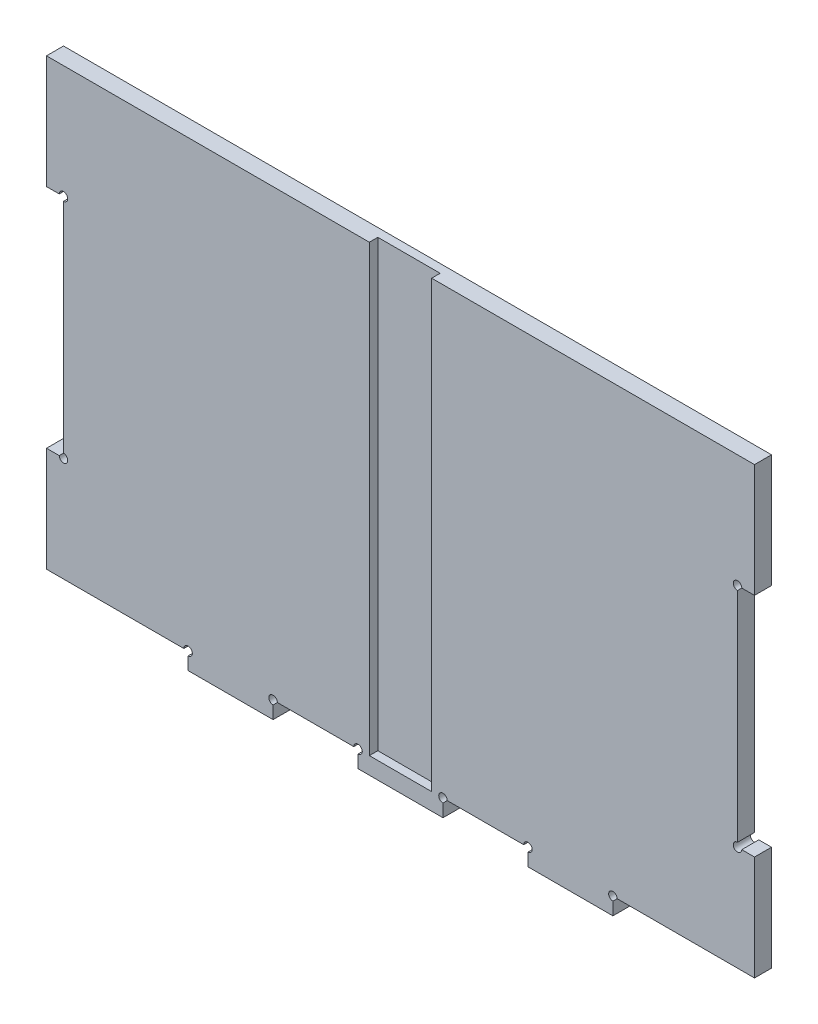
ISO-10303-21;
HEADER;
FILE_DESCRIPTION(('STEP AP214'),'2;1');
FILE_NAME('part.step','',(''),(''),'','','');
FILE_SCHEMA(('AUTOMOTIVE_DESIGN { 1 0 10303 214 1 1 1 1 }'));
ENDSEC;
DATA;
#1=APPLICATION_CONTEXT('core data for automotive mechanical design processes');
#2=APPLICATION_PROTOCOL_DEFINITION('international standard','automotive_design',2000,#1);
#3=PRODUCT_CONTEXT('',#1,'mechanical');
#4=PRODUCT('Part','Part','',(#3));
#5=PRODUCT_RELATED_PRODUCT_CATEGORY('part','',(#4));
#6=PRODUCT_DEFINITION_FORMATION('','',#4);
#7=PRODUCT_DEFINITION_CONTEXT('part definition',#1,'design');
#8=PRODUCT_DEFINITION('design','',#6,#7);
#9=PRODUCT_DEFINITION_SHAPE('','',#8);
#10=(LENGTH_UNIT() NAMED_UNIT(*) SI_UNIT(.MILLI.,.METRE.));
#11=(NAMED_UNIT(*) PLANE_ANGLE_UNIT() SI_UNIT($,.RADIAN.));
#12=(NAMED_UNIT(*) SI_UNIT($,.STERADIAN.) SOLID_ANGLE_UNIT());
#13=UNCERTAINTY_MEASURE_WITH_UNIT(LENGTH_MEASURE(1.E-05),#10,'distance_accuracy_value','');
#14=(GEOMETRIC_REPRESENTATION_CONTEXT(3) GLOBAL_UNCERTAINTY_ASSIGNED_CONTEXT((#13)) GLOBAL_UNIT_ASSIGNED_CONTEXT((#10,
#11,#12)) REPRESENTATION_CONTEXT('',''));
#15=CARTESIAN_POINT('',(0.,0.,0.));
#16=DIRECTION('',(0.,0.,1.));
#17=DIRECTION('',(1.,0.,0.));
#18=AXIS2_PLACEMENT_3D('',#15,#16,#17);
#19=CARTESIAN_POINT('',(-140.,80.,6.));
#20=DIRECTION('',(1.,0.,0.));
#21=DIRECTION('',(0.,0.,-1.));
#22=AXIS2_PLACEMENT_3D('',#19,#20,#21);
#23=PLANE('',#22);
#24=DIRECTION('',(0.,-1.,0.));
#25=VECTOR('',#24,1.);
#26=CARTESIAN_POINT('',(-140.,80.,0.));
#27=LINE('',#26,#25);
#28=CARTESIAN_POINT('',(-140.,120.,0.));
#29=VERTEX_POINT('',#28);
#30=CARTESIAN_POINT('',(-140.,80.,0.));
#31=VERTEX_POINT('',#30);
#32=EDGE_CURVE('E397',#29,#31,#27,.T.);
#33=ORIENTED_EDGE('',*,*,#32,.T.);
#34=DIRECTION('',(0.,0.,-1.));
#35=VECTOR('',#34,1.);
#36=CARTESIAN_POINT('',(-140.,80.,6.));
#37=LINE('',#36,#35);
#38=CARTESIAN_POINT('',(-140.,80.,6.));
#39=VERTEX_POINT('',#38);
#40=EDGE_CURVE('E552',#39,#31,#37,.T.);
#41=ORIENTED_EDGE('',*,*,#40,.F.);
#42=DIRECTION('',(0.,-1.,0.));
#43=VECTOR('',#42,1.);
#44=CARTESIAN_POINT('',(-140.,80.,6.));
#45=LINE('',#44,#43);
#46=CARTESIAN_POINT('',(-140.,120.,6.));
#47=VERTEX_POINT('',#46);
#48=EDGE_CURVE('E401',#47,#39,#45,.T.);
#49=ORIENTED_EDGE('',*,*,#48,.F.);
#50=DIRECTION('',(0.,0.,-1.));
#51=VECTOR('',#50,1.);
#52=CARTESIAN_POINT('',(-140.,120.,6.));
#53=LINE('',#52,#51);
#54=EDGE_CURVE('E555',#47,#29,#53,.T.);
#55=ORIENTED_EDGE('',*,*,#54,.T.);
#56=EDGE_LOOP('',(#33,#41,#49,#55));
#57=FACE_BOUND('',#56,.T.);
#58=ADVANCED_FACE('F30',(#57),#23,.F.);
#59=CARTESIAN_POINT('',(-134.,80.,6.));
#60=DIRECTION('',(0.,1.,0.));
#61=DIRECTION('',(0.,0.,1.));
#62=AXIS2_PLACEMENT_3D('',#59,#60,#61);
#63=PLANE('',#62);
#64=DIRECTION('',(1.,0.,0.));
#65=VECTOR('',#64,1.);
#66=CARTESIAN_POINT('',(-134.,80.,0.));
#67=LINE('',#66,#65);
#68=CARTESIAN_POINT('',(-135.5,80.,0.));
#69=VERTEX_POINT('',#68);
#70=EDGE_CURVE('E461',#31,#69,#67,.T.);
#71=ORIENTED_EDGE('',*,*,#70,.T.);
#72=DIRECTION('',(0.,0.,1.));
#73=VECTOR('',#72,1.);
#74=CARTESIAN_POINT('',(-135.5,80.,0.));
#75=LINE('',#74,#73);
#76=CARTESIAN_POINT('',(-135.5,80.,6.));
#77=VERTEX_POINT('',#76);
#78=EDGE_CURVE('E394',#69,#77,#75,.T.);
#79=ORIENTED_EDGE('',*,*,#78,.T.);
#80=DIRECTION('',(1.,0.,0.));
#81=VECTOR('',#80,1.);
#82=CARTESIAN_POINT('',(-134.,80.,6.));
#83=LINE('',#82,#81);
#84=EDGE_CURVE('E404',#39,#77,#83,.T.);
#85=ORIENTED_EDGE('',*,*,#84,.F.);
#86=ORIENTED_EDGE('',*,*,#40,.T.);
#87=EDGE_LOOP('',(#71,#79,#85,#86));
#88=FACE_BOUND('',#87,.T.);
#89=ADVANCED_FACE('F665',(#88),#63,.F.);
#90=CARTESIAN_POINT('',(-134.,0.,6.));
#91=DIRECTION('',(1.,0.,0.));
#92=DIRECTION('',(0.,0.,-1.));
#93=AXIS2_PLACEMENT_3D('',#90,#91,#92);
#94=PLANE('',#93);
#95=DIRECTION('',(0.,-1.,0.));
#96=VECTOR('',#95,1.);
#97=CARTESIAN_POINT('',(-134.,0.,0.));
#98=LINE('',#97,#96);
#99=CARTESIAN_POINT('',(-134.,78.5,0.));
#100=VERTEX_POINT('',#99);
#101=CARTESIAN_POINT('',(-134.,1.49999999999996,0.));
#102=VERTEX_POINT('',#101);
#103=EDGE_CURVE('E464',#100,#102,#98,.T.);
#104=ORIENTED_EDGE('',*,*,#103,.T.);
#105=DIRECTION('',(0.,0.,1.));
#106=VECTOR('',#105,1.);
#107=CARTESIAN_POINT('',(-134.,1.49999999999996,0.));
#108=LINE('',#107,#106);
#109=CARTESIAN_POINT('',(-134.,1.49999999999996,6.));
#110=VERTEX_POINT('',#109);
#111=EDGE_CURVE('E386',#102,#110,#108,.T.);
#112=ORIENTED_EDGE('',*,*,#111,.T.);
#113=DIRECTION('',(0.,-1.,0.));
#114=VECTOR('',#113,1.);
#115=CARTESIAN_POINT('',(-134.,0.,6.));
#116=LINE('',#115,#114);
#117=CARTESIAN_POINT('',(-134.,78.5,6.));
#118=VERTEX_POINT('',#117);
#119=EDGE_CURVE('E407',#118,#110,#116,.T.);
#120=ORIENTED_EDGE('',*,*,#119,.F.);
#121=DIRECTION('',(0.,0.,1.));
#122=VECTOR('',#121,1.);
#123=CARTESIAN_POINT('',(-134.,78.5,0.));
#124=LINE('',#123,#122);
#125=EDGE_CURVE('E391',#118,#100,#124,.F.);
#126=ORIENTED_EDGE('',*,*,#125,.T.);
#127=EDGE_LOOP('',(#104,#112,#120,#126));
#128=FACE_BOUND('',#127,.T.);
#129=ADVANCED_FACE('F658',(#128),#94,.F.);
#130=CARTESIAN_POINT('',(-140.,0.,6.));
#131=DIRECTION('',(0.,-1.,0.));
#132=DIRECTION('',(1.,0.,0.));
#133=AXIS2_PLACEMENT_3D('',#130,#131,#132);
#134=PLANE('',#133);
#135=DIRECTION('',(-1.,0.,0.));
#136=VECTOR('',#135,1.);
#137=CARTESIAN_POINT('',(-140.,0.,6.));
#138=LINE('',#137,#136);
#139=CARTESIAN_POINT('',(-135.5,0.,6.));
#140=VERTEX_POINT('',#139);
#141=CARTESIAN_POINT('',(-140.,0.,6.));
#142=VERTEX_POINT('',#141);
#143=EDGE_CURVE('E410',#140,#142,#138,.T.);
#144=ORIENTED_EDGE('',*,*,#143,.F.);
#145=DIRECTION('',(0.,0.,1.));
#146=VECTOR('',#145,1.);
#147=CARTESIAN_POINT('',(-135.5,0.,0.));
#148=LINE('',#147,#146);
#149=CARTESIAN_POINT('',(-135.5,0.,0.));
#150=VERTEX_POINT('',#149);
#151=EDGE_CURVE('E383',#140,#150,#148,.F.);
#152=ORIENTED_EDGE('',*,*,#151,.T.);
#153=DIRECTION('',(-1.,0.,0.));
#154=VECTOR('',#153,1.);
#155=CARTESIAN_POINT('',(-140.,0.,0.));
#156=LINE('',#155,#154);
#157=CARTESIAN_POINT('',(-140.,0.,0.));
#158=VERTEX_POINT('',#157);
#159=EDGE_CURVE('E467',#150,#158,#156,.T.);
#160=ORIENTED_EDGE('',*,*,#159,.T.);
#161=DIRECTION('',(0.,0.,-1.));
#162=VECTOR('',#161,1.);
#163=CARTESIAN_POINT('',(-140.,0.,6.));
#164=LINE('',#163,#162);
#165=EDGE_CURVE('E549',#142,#158,#164,.T.);
#166=ORIENTED_EDGE('',*,*,#165,.F.);
#167=EDGE_LOOP('',(#144,#152,#160,#166));
#168=FACE_BOUND('',#167,.T.);
#169=ADVANCED_FACE('F651',(#168),#134,.F.);
#170=CARTESIAN_POINT('',(-140.,-37.,6.));
#171=DIRECTION('',(1.,0.,0.));
#172=DIRECTION('',(0.,0.,-1.));
#173=AXIS2_PLACEMENT_3D('',#170,#171,#172);
#174=PLANE('',#173);
#175=DIRECTION('',(0.,-1.,0.));
#176=VECTOR('',#175,1.);
#177=CARTESIAN_POINT('',(-140.,-37.,0.));
#178=LINE('',#177,#176);
#179=CARTESIAN_POINT('',(-140.,-37.,0.));
#180=VERTEX_POINT('',#179);
#181=EDGE_CURVE('E469',#158,#180,#178,.T.);
#182=ORIENTED_EDGE('',*,*,#181,.T.);
#183=DIRECTION('',(0.,0.,-1.));
#184=VECTOR('',#183,1.);
#185=CARTESIAN_POINT('',(-140.,-37.,6.));
#186=LINE('',#185,#184);
#187=CARTESIAN_POINT('',(-140.,-37.,6.));
#188=VERTEX_POINT('',#187);
#189=EDGE_CURVE('E546',#188,#180,#186,.T.);
#190=ORIENTED_EDGE('',*,*,#189,.F.);
#191=DIRECTION('',(0.,-1.,0.));
#192=VECTOR('',#191,1.);
#193=CARTESIAN_POINT('',(-140.,-37.,6.));
#194=LINE('',#193,#192);
#195=EDGE_CURVE('E412',#142,#188,#194,.T.);
#196=ORIENTED_EDGE('',*,*,#195,.F.);
#197=ORIENTED_EDGE('',*,*,#165,.T.);
#198=EDGE_LOOP('',(#182,#190,#196,#197));
#199=FACE_BOUND('',#198,.T.);
#200=ADVANCED_FACE('F647',(#199),#174,.F.);
#201=CARTESIAN_POINT('',(-90.,-37.,6.));
#202=DIRECTION('',(0.,1.,0.));
#203=DIRECTION('',(-1.,0.,0.));
#204=AXIS2_PLACEMENT_3D('',#201,#202,#203);
#205=PLANE('',#204);
#206=DIRECTION('',(1.,0.,0.));
#207=VECTOR('',#206,1.);
#208=CARTESIAN_POINT('',(-90.,-37.,0.));
#209=LINE('',#208,#207);
#210=CARTESIAN_POINT('',(-91.5,-37.,0.));
#211=VERTEX_POINT('',#210);
#212=EDGE_CURVE('E471',#180,#211,#209,.T.);
#213=ORIENTED_EDGE('',*,*,#212,.T.);
#214=DIRECTION('',(0.,0.,1.));
#215=VECTOR('',#214,1.);
#216=CARTESIAN_POINT('',(-91.5,-37.,0.));
#217=LINE('',#216,#215);
#218=CARTESIAN_POINT('',(-91.5,-37.,6.));
#219=VERTEX_POINT('',#218);
#220=EDGE_CURVE('E378',#211,#219,#217,.T.);
#221=ORIENTED_EDGE('',*,*,#220,.T.);
#222=DIRECTION('',(1.,0.,0.));
#223=VECTOR('',#222,1.);
#224=CARTESIAN_POINT('',(-90.,-37.,6.));
#225=LINE('',#224,#223);
#226=EDGE_CURVE('E414',#188,#219,#225,.T.);
#227=ORIENTED_EDGE('',*,*,#226,.F.);
#228=ORIENTED_EDGE('',*,*,#189,.T.);
#229=EDGE_LOOP('',(#213,#221,#227,#228));
#230=FACE_BOUND('',#229,.T.);
#231=ADVANCED_FACE('F642',(#230),#205,.F.);
#232=CARTESIAN_POINT('',(-90.,-43.,6.));
#233=DIRECTION('',(1.,0.,0.));
#234=DIRECTION('',(0.,0.,-1.));
#235=AXIS2_PLACEMENT_3D('',#232,#233,#234);
#236=PLANE('',#235);
#237=DIRECTION('',(0.,-1.,0.));
#238=VECTOR('',#237,1.);
#239=CARTESIAN_POINT('',(-90.,-43.,6.));
#240=LINE('',#239,#238);
#241=CARTESIAN_POINT('',(-90.,-38.5,6.));
#242=VERTEX_POINT('',#241);
#243=CARTESIAN_POINT('',(-90.,-43.,6.));
#244=VERTEX_POINT('',#243);
#245=EDGE_CURVE('E417',#242,#244,#240,.T.);
#246=ORIENTED_EDGE('',*,*,#245,.F.);
#247=DIRECTION('',(0.,0.,1.));
#248=VECTOR('',#247,1.);
#249=CARTESIAN_POINT('',(-90.,-38.5,0.));
#250=LINE('',#249,#248);
#251=CARTESIAN_POINT('',(-90.,-38.5,0.));
#252=VERTEX_POINT('',#251);
#253=EDGE_CURVE('E375',#242,#252,#250,.F.);
#254=ORIENTED_EDGE('',*,*,#253,.T.);
#255=DIRECTION('',(0.,-1.,0.));
#256=VECTOR('',#255,1.);
#257=CARTESIAN_POINT('',(-90.,-43.,0.));
#258=LINE('',#257,#256);
#259=CARTESIAN_POINT('',(-90.,-43.,0.));
#260=VERTEX_POINT('',#259);
#261=EDGE_CURVE('E474',#252,#260,#258,.T.);
#262=ORIENTED_EDGE('',*,*,#261,.T.);
#263=DIRECTION('',(0.,0.,-1.));
#264=VECTOR('',#263,1.);
#265=CARTESIAN_POINT('',(-90.,-43.,6.));
#266=LINE('',#265,#264);
#267=EDGE_CURVE('E543',#244,#260,#266,.T.);
#268=ORIENTED_EDGE('',*,*,#267,.F.);
#269=EDGE_LOOP('',(#246,#254,#262,#268));
#270=FACE_BOUND('',#269,.T.);
#271=ADVANCED_FACE('F634',(#270),#236,.F.);
#272=CARTESIAN_POINT('',(-60.,-43.,6.));
#273=DIRECTION('',(0.,1.,0.));
#274=DIRECTION('',(-1.,0.,0.));
#275=AXIS2_PLACEMENT_3D('',#272,#273,#274);
#276=PLANE('',#275);
#277=DIRECTION('',(1.,0.,0.));
#278=VECTOR('',#277,1.);
#279=CARTESIAN_POINT('',(-60.,-43.,0.));
#280=LINE('',#279,#278);
#281=CARTESIAN_POINT('',(-60.,-43.,0.));
#282=VERTEX_POINT('',#281);
#283=EDGE_CURVE('E476',#260,#282,#280,.T.);
#284=ORIENTED_EDGE('',*,*,#283,.T.);
#285=DIRECTION('',(0.,0.,-1.));
#286=VECTOR('',#285,1.);
#287=CARTESIAN_POINT('',(-60.,-43.,6.));
#288=LINE('',#287,#286);
#289=CARTESIAN_POINT('',(-60.,-43.,6.));
#290=VERTEX_POINT('',#289);
#291=EDGE_CURVE('E540',#290,#282,#288,.T.);
#292=ORIENTED_EDGE('',*,*,#291,.F.);
#293=DIRECTION('',(1.,0.,0.));
#294=VECTOR('',#293,1.);
#295=CARTESIAN_POINT('',(-60.,-43.,6.));
#296=LINE('',#295,#294);
#297=EDGE_CURVE('E419',#244,#290,#296,.T.);
#298=ORIENTED_EDGE('',*,*,#297,.F.);
#299=ORIENTED_EDGE('',*,*,#267,.T.);
#300=EDGE_LOOP('',(#284,#292,#298,#299));
#301=FACE_BOUND('',#300,.T.);
#302=ADVANCED_FACE('F627',(#301),#276,.F.);
#303=CARTESIAN_POINT('',(-60.,-37.,6.));
#304=DIRECTION('',(-1.,0.,0.));
#305=DIRECTION('',(0.,0.,1.));
#306=AXIS2_PLACEMENT_3D('',#303,#304,#305);
#307=PLANE('',#306);
#308=DIRECTION('',(0.,1.,0.));
#309=VECTOR('',#308,1.);
#310=CARTESIAN_POINT('',(-60.,-37.,0.));
#311=LINE('',#310,#309);
#312=CARTESIAN_POINT('',(-60.,-38.5,0.));
#313=VERTEX_POINT('',#312);
#314=EDGE_CURVE('E478',#282,#313,#311,.T.);
#315=ORIENTED_EDGE('',*,*,#314,.T.);
#316=DIRECTION('',(0.,0.,1.));
#317=VECTOR('',#316,1.);
#318=CARTESIAN_POINT('',(-60.,-38.5,0.));
#319=LINE('',#318,#317);
#320=CARTESIAN_POINT('',(-60.,-38.5,6.));
#321=VERTEX_POINT('',#320);
#322=EDGE_CURVE('E370',#313,#321,#319,.T.);
#323=ORIENTED_EDGE('',*,*,#322,.T.);
#324=DIRECTION('',(0.,1.,0.));
#325=VECTOR('',#324,1.);
#326=CARTESIAN_POINT('',(-60.,-37.,6.));
#327=LINE('',#326,#325);
#328=EDGE_CURVE('E421',#290,#321,#327,.T.);
#329=ORIENTED_EDGE('',*,*,#328,.F.);
#330=ORIENTED_EDGE('',*,*,#291,.T.);
#331=EDGE_LOOP('',(#315,#323,#329,#330));
#332=FACE_BOUND('',#331,.T.);
#333=ADVANCED_FACE('F622',(#332),#307,.F.);
#334=CARTESIAN_POINT('',(-30.,-37.,6.));
#335=DIRECTION('',(0.,1.,0.));
#336=DIRECTION('',(-1.,0.,0.));
#337=AXIS2_PLACEMENT_3D('',#334,#335,#336);
#338=PLANE('',#337);
#339=DIRECTION('',(1.,0.,0.));
#340=VECTOR('',#339,1.);
#341=CARTESIAN_POINT('',(-30.,-37.,0.));
#342=LINE('',#341,#340);
#343=CARTESIAN_POINT('',(-58.5,-37.,0.));
#344=VERTEX_POINT('',#343);
#345=CARTESIAN_POINT('',(-31.5,-37.,0.));
#346=VERTEX_POINT('',#345);
#347=EDGE_CURVE('E481',#344,#346,#342,.T.);
#348=ORIENTED_EDGE('',*,*,#347,.T.);
#349=DIRECTION('',(0.,0.,1.));
#350=VECTOR('',#349,1.);
#351=CARTESIAN_POINT('',(-31.5,-37.,0.));
#352=LINE('',#351,#350);
#353=CARTESIAN_POINT('',(-31.5,-37.,6.));
#354=VERTEX_POINT('',#353);
#355=EDGE_CURVE('E359',#346,#354,#352,.T.);
#356=ORIENTED_EDGE('',*,*,#355,.T.);
#357=DIRECTION('',(1.,0.,0.));
#358=VECTOR('',#357,1.);
#359=CARTESIAN_POINT('',(-30.,-37.,6.));
#360=LINE('',#359,#358);
#361=CARTESIAN_POINT('',(-58.5,-37.,6.));
#362=VERTEX_POINT('',#361);
#363=EDGE_CURVE('E424',#362,#354,#360,.T.);
#364=ORIENTED_EDGE('',*,*,#363,.F.);
#365=DIRECTION('',(0.,0.,1.));
#366=VECTOR('',#365,1.);
#367=CARTESIAN_POINT('',(-58.5,-37.,0.));
#368=LINE('',#367,#366);
#369=EDGE_CURVE('E366',#362,#344,#368,.F.);
#370=ORIENTED_EDGE('',*,*,#369,.T.);
#371=EDGE_LOOP('',(#348,#356,#364,#370));
#372=FACE_BOUND('',#371,.T.);
#373=ADVANCED_FACE('F617',(#372),#338,.F.);
#374=CARTESIAN_POINT('',(-30.,-43.,6.));
#375=DIRECTION('',(1.,0.,0.));
#376=DIRECTION('',(0.,0.,-1.));
#377=AXIS2_PLACEMENT_3D('',#374,#375,#376);
#378=PLANE('',#377);
#379=DIRECTION('',(0.,-1.,0.));
#380=VECTOR('',#379,1.);
#381=CARTESIAN_POINT('',(-30.,-43.,6.));
#382=LINE('',#381,#380);
#383=CARTESIAN_POINT('',(-30.,-38.5,6.));
#384=VERTEX_POINT('',#383);
#385=CARTESIAN_POINT('',(-30.,-43.,6.));
#386=VERTEX_POINT('',#385);
#387=EDGE_CURVE('E427',#384,#386,#382,.T.);
#388=ORIENTED_EDGE('',*,*,#387,.F.);
#389=DIRECTION('',(0.,0.,1.));
#390=VECTOR('',#389,1.);
#391=CARTESIAN_POINT('',(-30.,-38.5,0.));
#392=LINE('',#391,#390);
#393=CARTESIAN_POINT('',(-30.,-38.5,0.));
#394=VERTEX_POINT('',#393);
#395=EDGE_CURVE('E356',#384,#394,#392,.F.);
#396=ORIENTED_EDGE('',*,*,#395,.T.);
#397=DIRECTION('',(0.,-1.,0.));
#398=VECTOR('',#397,1.);
#399=CARTESIAN_POINT('',(-30.,-43.,0.));
#400=LINE('',#399,#398);
#401=CARTESIAN_POINT('',(-30.,-43.,0.));
#402=VERTEX_POINT('',#401);
#403=EDGE_CURVE('E484',#394,#402,#400,.T.);
#404=ORIENTED_EDGE('',*,*,#403,.T.);
#405=DIRECTION('',(0.,0.,-1.));
#406=VECTOR('',#405,1.);
#407=CARTESIAN_POINT('',(-30.,-43.,6.));
#408=LINE('',#407,#406);
#409=EDGE_CURVE('E537',#386,#402,#408,.T.);
#410=ORIENTED_EDGE('',*,*,#409,.F.);
#411=EDGE_LOOP('',(#388,#396,#404,#410));
#412=FACE_BOUND('',#411,.T.);
#413=ADVANCED_FACE('F610',(#412),#378,.F.);
#414=CARTESIAN_POINT('',(0.,-43.,6.));
#415=DIRECTION('',(0.,1.,0.));
#416=DIRECTION('',(0.,0.,1.));
#417=AXIS2_PLACEMENT_3D('',#414,#415,#416);
#418=PLANE('',#417);
#419=DIRECTION('',(1.,0.,0.));
#420=VECTOR('',#419,1.);
#421=CARTESIAN_POINT('',(0.,-43.,0.));
#422=LINE('',#421,#420);
#423=CARTESIAN_POINT('',(0.,-43.,0.));
#424=VERTEX_POINT('',#423);
#425=EDGE_CURVE('E486',#402,#424,#422,.T.);
#426=ORIENTED_EDGE('',*,*,#425,.T.);
#427=DIRECTION('',(0.,0.,-1.));
#428=VECTOR('',#427,1.);
#429=CARTESIAN_POINT('',(0.,-43.,6.));
#430=LINE('',#429,#428);
#431=CARTESIAN_POINT('',(0.,-43.,6.));
#432=VERTEX_POINT('',#431);
#433=EDGE_CURVE('E534',#432,#424,#430,.T.);
#434=ORIENTED_EDGE('',*,*,#433,.F.);
#435=DIRECTION('',(1.,0.,0.));
#436=VECTOR('',#435,1.);
#437=CARTESIAN_POINT('',(0.,-43.,6.));
#438=LINE('',#437,#436);
#439=EDGE_CURVE('E429',#386,#432,#438,.T.);
#440=ORIENTED_EDGE('',*,*,#439,.F.);
#441=ORIENTED_EDGE('',*,*,#409,.T.);
#442=EDGE_LOOP('',(#426,#434,#440,#441));
#443=FACE_BOUND('',#442,.T.);
#444=ADVANCED_FACE('F603',(#443),#418,.F.);
#445=CARTESIAN_POINT('',(0.,-37.,6.));
#446=DIRECTION('',(-1.,0.,0.));
#447=DIRECTION('',(0.,-1.,0.));
#448=AXIS2_PLACEMENT_3D('',#445,#446,#447);
#449=PLANE('',#448);
#450=DIRECTION('',(0.,1.,0.));
#451=VECTOR('',#450,1.);
#452=CARTESIAN_POINT('',(0.,-37.,0.));
#453=LINE('',#452,#451);
#454=CARTESIAN_POINT('',(0.,-38.5,0.));
#455=VERTEX_POINT('',#454);
#456=EDGE_CURVE('E488',#424,#455,#453,.T.);
#457=ORIENTED_EDGE('',*,*,#456,.T.);
#458=DIRECTION('',(0.,0.,1.));
#459=VECTOR('',#458,1.);
#460=CARTESIAN_POINT('',(0.,-38.5,0.));
#461=LINE('',#460,#459);
#462=CARTESIAN_POINT('',(0.,-38.5,6.));
#463=VERTEX_POINT('',#462);
#464=EDGE_CURVE('E351',#455,#463,#461,.T.);
#465=ORIENTED_EDGE('',*,*,#464,.T.);
#466=DIRECTION('',(0.,1.,0.));
#467=VECTOR('',#466,1.);
#468=CARTESIAN_POINT('',(0.,-37.,6.));
#469=LINE('',#468,#467);
#470=EDGE_CURVE('E431',#432,#463,#469,.T.);
#471=ORIENTED_EDGE('',*,*,#470,.F.);
#472=ORIENTED_EDGE('',*,*,#433,.T.);
#473=EDGE_LOOP('',(#457,#465,#471,#472));
#474=FACE_BOUND('',#473,.T.);
#475=ADVANCED_FACE('F598',(#474),#449,.F.);
#476=CARTESIAN_POINT('',(30.,-37.,6.));
#477=DIRECTION('',(0.,1.,0.));
#478=DIRECTION('',(-1.,0.,0.));
#479=AXIS2_PLACEMENT_3D('',#476,#477,#478);
#480=PLANE('',#479);
#481=DIRECTION('',(1.,0.,0.));
#482=VECTOR('',#481,1.);
#483=CARTESIAN_POINT('',(30.,-37.,0.));
#484=LINE('',#483,#482);
#485=CARTESIAN_POINT('',(1.5,-37.,0.));
#486=VERTEX_POINT('',#485);
#487=CARTESIAN_POINT('',(28.5,-37.,0.));
#488=VERTEX_POINT('',#487);
#489=EDGE_CURVE('E491',#486,#488,#484,.T.);
#490=ORIENTED_EDGE('',*,*,#489,.T.);
#491=DIRECTION('',(0.,0.,1.));
#492=VECTOR('',#491,1.);
#493=CARTESIAN_POINT('',(28.5,-37.,0.));
#494=LINE('',#493,#492);
#495=CARTESIAN_POINT('',(28.5,-37.,6.));
#496=VERTEX_POINT('',#495);
#497=EDGE_CURVE('E340',#488,#496,#494,.T.);
#498=ORIENTED_EDGE('',*,*,#497,.T.);
#499=DIRECTION('',(1.,0.,0.));
#500=VECTOR('',#499,1.);
#501=CARTESIAN_POINT('',(30.,-37.,6.));
#502=LINE('',#501,#500);
#503=CARTESIAN_POINT('',(1.5,-37.,6.));
#504=VERTEX_POINT('',#503);
#505=EDGE_CURVE('E434',#504,#496,#502,.T.);
#506=ORIENTED_EDGE('',*,*,#505,.F.);
#507=DIRECTION('',(0.,0.,1.));
#508=VECTOR('',#507,1.);
#509=CARTESIAN_POINT('',(1.5,-37.,0.));
#510=LINE('',#509,#508);
#511=EDGE_CURVE('E347',#504,#486,#510,.F.);
#512=ORIENTED_EDGE('',*,*,#511,.T.);
#513=EDGE_LOOP('',(#490,#498,#506,#512));
#514=FACE_BOUND('',#513,.T.);
#515=ADVANCED_FACE('F593',(#514),#480,.F.);
#516=CARTESIAN_POINT('',(30.,-43.,6.));
#517=DIRECTION('',(1.,0.,0.));
#518=DIRECTION('',(0.,1.,0.));
#519=AXIS2_PLACEMENT_3D('',#516,#517,#518);
#520=PLANE('',#519);
#521=DIRECTION('',(0.,-1.,0.));
#522=VECTOR('',#521,1.);
#523=CARTESIAN_POINT('',(30.,-43.,6.));
#524=LINE('',#523,#522);
#525=CARTESIAN_POINT('',(30.,-38.5,6.));
#526=VERTEX_POINT('',#525);
#527=CARTESIAN_POINT('',(30.,-43.,6.));
#528=VERTEX_POINT('',#527);
#529=EDGE_CURVE('E437',#526,#528,#524,.T.);
#530=ORIENTED_EDGE('',*,*,#529,.F.);
#531=DIRECTION('',(0.,0.,1.));
#532=VECTOR('',#531,1.);
#533=CARTESIAN_POINT('',(30.,-38.5,0.));
#534=LINE('',#533,#532);
#535=CARTESIAN_POINT('',(30.,-38.5,0.));
#536=VERTEX_POINT('',#535);
#537=EDGE_CURVE('E337',#526,#536,#534,.F.);
#538=ORIENTED_EDGE('',*,*,#537,.T.);
#539=DIRECTION('',(0.,-1.,0.));
#540=VECTOR('',#539,1.);
#541=CARTESIAN_POINT('',(30.,-43.,0.));
#542=LINE('',#541,#540);
#543=CARTESIAN_POINT('',(30.,-43.,0.));
#544=VERTEX_POINT('',#543);
#545=EDGE_CURVE('E494',#536,#544,#542,.T.);
#546=ORIENTED_EDGE('',*,*,#545,.T.);
#547=DIRECTION('',(0.,0.,-1.));
#548=VECTOR('',#547,1.);
#549=CARTESIAN_POINT('',(30.,-43.,6.));
#550=LINE('',#549,#548);
#551=EDGE_CURVE('E531',#528,#544,#550,.T.);
#552=ORIENTED_EDGE('',*,*,#551,.F.);
#553=EDGE_LOOP('',(#530,#538,#546,#552));
#554=FACE_BOUND('',#553,.T.);
#555=ADVANCED_FACE('F574',(#554),#520,.F.);
#556=CARTESIAN_POINT('',(60.,-43.,6.));
#557=DIRECTION('',(0.,1.,0.));
#558=DIRECTION('',(-1.,0.,0.));
#559=AXIS2_PLACEMENT_3D('',#556,#557,#558);
#560=PLANE('',#559);
#561=DIRECTION('',(1.,0.,0.));
#562=VECTOR('',#561,1.);
#563=CARTESIAN_POINT('',(60.,-43.,0.));
#564=LINE('',#563,#562);
#565=CARTESIAN_POINT('',(60.,-43.,0.));
#566=VERTEX_POINT('',#565);
#567=EDGE_CURVE('E496',#544,#566,#564,.T.);
#568=ORIENTED_EDGE('',*,*,#567,.T.);
#569=DIRECTION('',(0.,0.,-1.));
#570=VECTOR('',#569,1.);
#571=CARTESIAN_POINT('',(60.,-43.,6.));
#572=LINE('',#571,#570);
#573=CARTESIAN_POINT('',(60.,-43.,6.));
#574=VERTEX_POINT('',#573);
#575=EDGE_CURVE('E528',#574,#566,#572,.T.);
#576=ORIENTED_EDGE('',*,*,#575,.F.);
#577=DIRECTION('',(1.,0.,0.));
#578=VECTOR('',#577,1.);
#579=CARTESIAN_POINT('',(60.,-43.,6.));
#580=LINE('',#579,#578);
#581=EDGE_CURVE('E439',#528,#574,#580,.T.);
#582=ORIENTED_EDGE('',*,*,#581,.F.);
#583=ORIENTED_EDGE('',*,*,#551,.T.);
#584=EDGE_LOOP('',(#568,#576,#582,#583));
#585=FACE_BOUND('',#584,.T.);
#586=ADVANCED_FACE('F581',(#585),#560,.F.);
#587=CARTESIAN_POINT('',(60.,-37.,6.));
#588=DIRECTION('',(-1.,0.,0.));
#589=DIRECTION('',(0.,0.,1.));
#590=AXIS2_PLACEMENT_3D('',#587,#588,#589);
#591=PLANE('',#590);
#592=DIRECTION('',(0.,1.,0.));
#593=VECTOR('',#592,1.);
#594=CARTESIAN_POINT('',(60.,-37.,0.));
#595=LINE('',#594,#593);
#596=CARTESIAN_POINT('',(60.,-38.5,0.));
#597=VERTEX_POINT('',#596);
#598=EDGE_CURVE('E498',#566,#597,#595,.T.);
#599=ORIENTED_EDGE('',*,*,#598,.T.);
#600=DIRECTION('',(0.,0.,1.));
#601=VECTOR('',#600,1.);
#602=CARTESIAN_POINT('',(60.,-38.5,0.));
#603=LINE('',#602,#601);
#604=CARTESIAN_POINT('',(60.,-38.5,6.));
#605=VERTEX_POINT('',#604);
#606=EDGE_CURVE('E332',#597,#605,#603,.T.);
#607=ORIENTED_EDGE('',*,*,#606,.T.);
#608=DIRECTION('',(0.,1.,0.));
#609=VECTOR('',#608,1.);
#610=CARTESIAN_POINT('',(60.,-37.,6.));
#611=LINE('',#610,#609);
#612=EDGE_CURVE('E441',#574,#605,#611,.T.);
#613=ORIENTED_EDGE('',*,*,#612,.F.);
#614=ORIENTED_EDGE('',*,*,#575,.T.);
#615=EDGE_LOOP('',(#599,#607,#613,#614));
#616=FACE_BOUND('',#615,.T.);
#617=ADVANCED_FACE('F585',(#616),#591,.F.);
#618=CARTESIAN_POINT('',(110.,-37.,6.));
#619=DIRECTION('',(0.,1.,0.));
#620=DIRECTION('',(0.,0.,1.));
#621=AXIS2_PLACEMENT_3D('',#618,#619,#620);
#622=PLANE('',#621);
#623=DIRECTION('',(1.,0.,0.));
#624=VECTOR('',#623,1.);
#625=CARTESIAN_POINT('',(110.,-37.,6.));
#626=LINE('',#625,#624);
#627=CARTESIAN_POINT('',(61.5,-37.,6.));
#628=VERTEX_POINT('',#627);
#629=CARTESIAN_POINT('',(110.,-37.,6.));
#630=VERTEX_POINT('',#629);
#631=EDGE_CURVE('E444',#628,#630,#626,.T.);
#632=ORIENTED_EDGE('',*,*,#631,.F.);
#633=DIRECTION('',(0.,0.,1.));
#634=VECTOR('',#633,1.);
#635=CARTESIAN_POINT('',(61.5,-37.,0.));
#636=LINE('',#635,#634);
#637=CARTESIAN_POINT('',(61.5,-37.,0.));
#638=VERTEX_POINT('',#637);
#639=EDGE_CURVE('E328',#628,#638,#636,.F.);
#640=ORIENTED_EDGE('',*,*,#639,.T.);
#641=DIRECTION('',(1.,0.,0.));
#642=VECTOR('',#641,1.);
#643=CARTESIAN_POINT('',(110.,-37.,0.));
#644=LINE('',#643,#642);
#645=CARTESIAN_POINT('',(110.,-37.,0.));
#646=VERTEX_POINT('',#645);
#647=EDGE_CURVE('E501',#638,#646,#644,.T.);
#648=ORIENTED_EDGE('',*,*,#647,.T.);
#649=DIRECTION('',(0.,0.,-1.));
#650=VECTOR('',#649,1.);
#651=CARTESIAN_POINT('',(110.,-37.,6.));
#652=LINE('',#651,#650);
#653=EDGE_CURVE('E525',#630,#646,#652,.T.);
#654=ORIENTED_EDGE('',*,*,#653,.F.);
#655=EDGE_LOOP('',(#632,#640,#648,#654));
#656=FACE_BOUND('',#655,.T.);
#657=ADVANCED_FACE('F706',(#656),#622,.F.);
#658=CARTESIAN_POINT('',(110.,0.,6.));
#659=DIRECTION('',(-1.,0.,0.));
#660=DIRECTION('',(0.,0.,1.));
#661=AXIS2_PLACEMENT_3D('',#658,#659,#660);
#662=PLANE('',#661);
#663=DIRECTION('',(0.,1.,0.));
#664=VECTOR('',#663,1.);
#665=CARTESIAN_POINT('',(110.,0.,0.));
#666=LINE('',#665,#664);
#667=CARTESIAN_POINT('',(110.,0.,0.));
#668=VERTEX_POINT('',#667);
#669=EDGE_CURVE('E503',#646,#668,#666,.T.);
#670=ORIENTED_EDGE('',*,*,#669,.T.);
#671=DIRECTION('',(0.,0.,-1.));
#672=VECTOR('',#671,1.);
#673=CARTESIAN_POINT('',(110.,0.,6.));
#674=LINE('',#673,#672);
#675=CARTESIAN_POINT('',(110.,0.,6.));
#676=VERTEX_POINT('',#675);
#677=EDGE_CURVE('E522',#676,#668,#674,.T.);
#678=ORIENTED_EDGE('',*,*,#677,.F.);
#679=DIRECTION('',(0.,1.,0.));
#680=VECTOR('',#679,1.);
#681=CARTESIAN_POINT('',(110.,0.,6.));
#682=LINE('',#681,#680);
#683=EDGE_CURVE('E446',#630,#676,#682,.T.);
#684=ORIENTED_EDGE('',*,*,#683,.F.);
#685=ORIENTED_EDGE('',*,*,#653,.T.);
#686=EDGE_LOOP('',(#670,#678,#684,#685));
#687=FACE_BOUND('',#686,.T.);
#688=ADVANCED_FACE('F703',(#687),#662,.F.);
#689=CARTESIAN_POINT('',(104.,0.,6.));
#690=DIRECTION('',(0.,-1.,0.));
#691=DIRECTION('',(1.,0.,0.));
#692=AXIS2_PLACEMENT_3D('',#689,#690,#691);
#693=PLANE('',#692);
#694=DIRECTION('',(-1.,0.,0.));
#695=VECTOR('',#694,1.);
#696=CARTESIAN_POINT('',(104.,0.,0.));
#697=LINE('',#696,#695);
#698=CARTESIAN_POINT('',(105.5,0.,0.));
#699=VERTEX_POINT('',#698);
#700=EDGE_CURVE('E505',#668,#699,#697,.T.);
#701=ORIENTED_EDGE('',*,*,#700,.T.);
#702=DIRECTION('',(0.,0.,1.));
#703=VECTOR('',#702,1.);
#704=CARTESIAN_POINT('',(105.5,0.,0.));
#705=LINE('',#704,#703);
#706=CARTESIAN_POINT('',(105.5,0.,6.));
#707=VERTEX_POINT('',#706);
#708=EDGE_CURVE('E321',#699,#707,#705,.T.);
#709=ORIENTED_EDGE('',*,*,#708,.T.);
#710=DIRECTION('',(-1.,0.,0.));
#711=VECTOR('',#710,1.);
#712=CARTESIAN_POINT('',(104.,0.,6.));
#713=LINE('',#712,#711);
#714=EDGE_CURVE('E448',#676,#707,#713,.T.);
#715=ORIENTED_EDGE('',*,*,#714,.F.);
#716=ORIENTED_EDGE('',*,*,#677,.T.);
#717=EDGE_LOOP('',(#701,#709,#715,#716));
#718=FACE_BOUND('',#717,.T.);
#719=ADVANCED_FACE('F698',(#718),#693,.F.);
#720=CARTESIAN_POINT('',(104.,80.,6.));
#721=DIRECTION('',(-1.,0.,0.));
#722=DIRECTION('',(0.,0.,1.));
#723=AXIS2_PLACEMENT_3D('',#720,#721,#722);
#724=PLANE('',#723);
#725=DIRECTION('',(0.,1.,0.));
#726=VECTOR('',#725,1.);
#727=CARTESIAN_POINT('',(104.,80.,0.));
#728=LINE('',#727,#726);
#729=CARTESIAN_POINT('',(104.,1.49999999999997,0.));
#730=VERTEX_POINT('',#729);
#731=CARTESIAN_POINT('',(104.,78.5,0.));
#732=VERTEX_POINT('',#731);
#733=EDGE_CURVE('E508',#730,#732,#728,.T.);
#734=ORIENTED_EDGE('',*,*,#733,.T.);
#735=DIRECTION('',(0.,0.,1.));
#736=VECTOR('',#735,1.);
#737=CARTESIAN_POINT('',(104.,78.5,0.));
#738=LINE('',#737,#736);
#739=CARTESIAN_POINT('',(104.,78.5,6.));
#740=VERTEX_POINT('',#739);
#741=EDGE_CURVE('E52',#732,#740,#738,.T.);
#742=ORIENTED_EDGE('',*,*,#741,.T.);
#743=DIRECTION('',(0.,1.,0.));
#744=VECTOR('',#743,1.);
#745=CARTESIAN_POINT('',(104.,80.,6.));
#746=LINE('',#745,#744);
#747=CARTESIAN_POINT('',(104.,1.49999999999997,6.));
#748=VERTEX_POINT('',#747);
#749=EDGE_CURVE('E451',#748,#740,#746,.T.);
#750=ORIENTED_EDGE('',*,*,#749,.F.);
#751=DIRECTION('',(0.,0.,1.));
#752=VECTOR('',#751,1.);
#753=CARTESIAN_POINT('',(104.,1.49999999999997,0.));
#754=LINE('',#753,#752);
#755=EDGE_CURVE('E318',#748,#730,#754,.F.);
#756=ORIENTED_EDGE('',*,*,#755,.T.);
#757=EDGE_LOOP('',(#734,#742,#750,#756));
#758=FACE_BOUND('',#757,.T.);
#759=ADVANCED_FACE('F688',(#758),#724,.F.);
#760=CARTESIAN_POINT('',(110.,80.,6.));
#761=DIRECTION('',(0.,1.,0.));
#762=DIRECTION('',(-1.,0.,0.));
#763=AXIS2_PLACEMENT_3D('',#760,#761,#762);
#764=PLANE('',#763);
#765=DIRECTION('',(1.,0.,0.));
#766=VECTOR('',#765,1.);
#767=CARTESIAN_POINT('',(110.,80.,6.));
#768=LINE('',#767,#766);
#769=CARTESIAN_POINT('',(105.5,80.,6.));
#770=VERTEX_POINT('',#769);
#771=CARTESIAN_POINT('',(110.,80.,6.));
#772=VERTEX_POINT('',#771);
#773=EDGE_CURVE('E454',#770,#772,#768,.T.);
#774=ORIENTED_EDGE('',*,*,#773,.F.);
#775=DIRECTION('',(0.,0.,1.));
#776=VECTOR('',#775,1.);
#777=CARTESIAN_POINT('',(105.5,80.,0.));
#778=LINE('',#777,#776);
#779=CARTESIAN_POINT('',(105.5,80.,0.));
#780=VERTEX_POINT('',#779);
#781=EDGE_CURVE('E311',#770,#780,#778,.F.);
#782=ORIENTED_EDGE('',*,*,#781,.T.);
#783=DIRECTION('',(1.,0.,0.));
#784=VECTOR('',#783,1.);
#785=CARTESIAN_POINT('',(110.,80.,0.));
#786=LINE('',#785,#784);
#787=CARTESIAN_POINT('',(110.,80.,0.));
#788=VERTEX_POINT('',#787);
#789=EDGE_CURVE('E511',#780,#788,#786,.T.);
#790=ORIENTED_EDGE('',*,*,#789,.T.);
#791=DIRECTION('',(0.,0.,-1.));
#792=VECTOR('',#791,1.);
#793=CARTESIAN_POINT('',(110.,80.,6.));
#794=LINE('',#793,#792);
#795=EDGE_CURVE('E519',#772,#788,#794,.T.);
#796=ORIENTED_EDGE('',*,*,#795,.F.);
#797=EDGE_LOOP('',(#774,#782,#790,#796));
#798=FACE_BOUND('',#797,.T.);
#799=ADVANCED_FACE('F684',(#798),#764,.F.);
#800=CARTESIAN_POINT('',(110.,120.,6.));
#801=DIRECTION('',(-1.,0.,0.));
#802=DIRECTION('',(0.,-1.,0.));
#803=AXIS2_PLACEMENT_3D('',#800,#801,#802);
#804=PLANE('',#803);
#805=DIRECTION('',(0.,1.,0.));
#806=VECTOR('',#805,1.);
#807=CARTESIAN_POINT('',(110.,120.,0.));
#808=LINE('',#807,#806);
#809=CARTESIAN_POINT('',(110.,120.,0.));
#810=VERTEX_POINT('',#809);
#811=EDGE_CURVE('E513',#788,#810,#808,.T.);
#812=ORIENTED_EDGE('',*,*,#811,.T.);
#813=DIRECTION('',(0.,0.,-1.));
#814=VECTOR('',#813,1.);
#815=CARTESIAN_POINT('',(110.,120.,6.));
#816=LINE('',#815,#814);
#817=CARTESIAN_POINT('',(110.,120.,6.));
#818=VERTEX_POINT('',#817);
#819=EDGE_CURVE('E459',#818,#810,#816,.T.);
#820=ORIENTED_EDGE('',*,*,#819,.F.);
#821=DIRECTION('',(0.,1.,0.));
#822=VECTOR('',#821,1.);
#823=CARTESIAN_POINT('',(110.,120.,6.));
#824=LINE('',#823,#822);
#825=EDGE_CURVE('E456',#772,#818,#824,.T.);
#826=ORIENTED_EDGE('',*,*,#825,.F.);
#827=ORIENTED_EDGE('',*,*,#795,.T.);
#828=EDGE_LOOP('',(#812,#820,#826,#827));
#829=FACE_BOUND('',#828,.T.);
#830=ADVANCED_FACE('F680',(#829),#804,.F.);
#831=CARTESIAN_POINT('',(-63.2091061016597,120.,6.));
#832=DIRECTION('',(0.,-1.,0.));
#833=DIRECTION('',(0.,0.,-1.));
#834=AXIS2_PLACEMENT_3D('',#831,#832,#833);
#835=PLANE('',#834);
#836=DIRECTION('',(-1.,0.,0.));
#837=VECTOR('',#836,1.);
#838=CARTESIAN_POINT('',(-140.,120.,6.));
#839=LINE('',#838,#837);
#840=CARTESIAN_POINT('',(-26.,120.,6.));
#841=VERTEX_POINT('',#840);
#842=EDGE_CURVE('E402',#841,#47,#839,.T.);
#843=ORIENTED_EDGE('',*,*,#842,.F.);
#844=DIRECTION('',(0.,0.,1.));
#845=VECTOR('',#844,1.);
#846=CARTESIAN_POINT('',(-26.,120.,3.));
#847=LINE('',#846,#845);
#848=CARTESIAN_POINT('',(-26.,120.,3.));
#849=VERTEX_POINT('',#848);
#850=EDGE_CURVE('E302',#849,#841,#847,.T.);
#851=ORIENTED_EDGE('',*,*,#850,.F.);
#852=DIRECTION('',(-1.,0.,0.));
#853=VECTOR('',#852,1.);
#854=CARTESIAN_POINT('',(-26.,120.,3.));
#855=LINE('',#854,#853);
#856=CARTESIAN_POINT('',(-4.00000000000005,120.,3.));
#857=VERTEX_POINT('',#856);
#858=EDGE_CURVE('E280',#857,#849,#855,.T.);
#859=ORIENTED_EDGE('',*,*,#858,.F.);
#860=DIRECTION('',(0.,0.,1.));
#861=VECTOR('',#860,1.);
#862=CARTESIAN_POINT('',(-4.00000000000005,120.,3.));
#863=LINE('',#862,#861);
#864=CARTESIAN_POINT('',(-4.00000000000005,120.,6.));
#865=VERTEX_POINT('',#864);
#866=EDGE_CURVE('E305',#857,#865,#863,.T.);
#867=ORIENTED_EDGE('',*,*,#866,.T.);
#868=EDGE_CURVE('E398',#818,#865,#839,.T.);
#869=ORIENTED_EDGE('',*,*,#868,.F.);
#870=ORIENTED_EDGE('',*,*,#819,.T.);
#871=DIRECTION('',(-1.,0.,0.));
#872=VECTOR('',#871,1.);
#873=CARTESIAN_POINT('',(-63.2091061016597,120.,0.));
#874=LINE('',#873,#872);
#875=EDGE_CURVE('E515',#810,#29,#874,.T.);
#876=ORIENTED_EDGE('',*,*,#875,.T.);
#877=ORIENTED_EDGE('',*,*,#54,.F.);
#878=EDGE_LOOP('',(#843,#851,#859,#867,#869,#870,#876,#877));
#879=FACE_BOUND('',#878,.T.);
#880=ADVANCED_FACE('F676',(#879),#835,.F.);
#881=CARTESIAN_POINT('',(110.,120.,6.));
#882=DIRECTION('',(0.,0.,-1.));
#883=DIRECTION('',(-1.,0.,0.));
#884=AXIS2_PLACEMENT_3D('',#881,#882,#883);
#885=PLANE('',#884);
#886=DIRECTION('',(1.,0.,0.));
#887=VECTOR('',#886,1.);
#888=CARTESIAN_POINT('',(-26.,-37.,6.));
#889=LINE('',#888,#887);
#890=CARTESIAN_POINT('',(-26.,-37.,6.));
#891=VERTEX_POINT('',#890);
#892=CARTESIAN_POINT('',(-4.00000000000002,-37.,6.));
#893=VERTEX_POINT('',#892);
#894=EDGE_CURVE('E295',#891,#893,#889,.T.);
#895=ORIENTED_EDGE('',*,*,#894,.F.);
#896=DIRECTION('',(0.,-1.,0.));
#897=VECTOR('',#896,1.);
#898=CARTESIAN_POINT('',(-26.,120.,6.));
#899=LINE('',#898,#897);
#900=EDGE_CURVE('E44',#841,#891,#899,.T.);
#901=ORIENTED_EDGE('',*,*,#900,.F.);
#902=ORIENTED_EDGE('',*,*,#842,.T.);
#903=ORIENTED_EDGE('',*,*,#48,.T.);
#904=ORIENTED_EDGE('',*,*,#84,.T.);
#905=CARTESIAN_POINT('',(-134.,80.,6.));
#906=DIRECTION('',(0.,0.,1.));
#907=DIRECTION('',(1.,0.,0.));
#908=AXIS2_PLACEMENT_3D('',#905,#906,#907);
#909=CIRCLE('',#908,1.5);
#910=EDGE_CURVE('E389',#118,#77,#909,.T.);
#911=ORIENTED_EDGE('',*,*,#910,.F.);
#912=ORIENTED_EDGE('',*,*,#119,.T.);
#913=CARTESIAN_POINT('',(-134.,0.,6.));
#914=DIRECTION('',(0.,0.,1.));
#915=DIRECTION('',(1.,0.,0.));
#916=AXIS2_PLACEMENT_3D('',#913,#914,#915);
#917=CIRCLE('',#916,1.5);
#918=EDGE_CURVE('E381',#140,#110,#917,.T.);
#919=ORIENTED_EDGE('',*,*,#918,.F.);
#920=ORIENTED_EDGE('',*,*,#143,.T.);
#921=ORIENTED_EDGE('',*,*,#195,.T.);
#922=ORIENTED_EDGE('',*,*,#226,.T.);
#923=CARTESIAN_POINT('',(-90.,-37.,6.));
#924=DIRECTION('',(0.,0.,1.));
#925=DIRECTION('',(1.,0.,0.));
#926=AXIS2_PLACEMENT_3D('',#923,#924,#925);
#927=CIRCLE('',#926,1.5);
#928=EDGE_CURVE('E373',#242,#219,#927,.T.);
#929=ORIENTED_EDGE('',*,*,#928,.F.);
#930=ORIENTED_EDGE('',*,*,#245,.T.);
#931=ORIENTED_EDGE('',*,*,#297,.T.);
#932=ORIENTED_EDGE('',*,*,#328,.T.);
#933=CARTESIAN_POINT('',(-60.,-37.,6.));
#934=DIRECTION('',(0.,0.,1.));
#935=DIRECTION('',(1.,0.,0.));
#936=AXIS2_PLACEMENT_3D('',#933,#934,#935);
#937=CIRCLE('',#936,1.5);
#938=EDGE_CURVE('E362',#362,#321,#937,.T.);
#939=ORIENTED_EDGE('',*,*,#938,.F.);
#940=ORIENTED_EDGE('',*,*,#363,.T.);
#941=CARTESIAN_POINT('',(-30.,-37.,6.));
#942=DIRECTION('',(0.,0.,1.));
#943=DIRECTION('',(1.,0.,0.));
#944=AXIS2_PLACEMENT_3D('',#941,#942,#943);
#945=CIRCLE('',#944,1.5);
#946=EDGE_CURVE('E354',#384,#354,#945,.T.);
#947=ORIENTED_EDGE('',*,*,#946,.F.);
#948=ORIENTED_EDGE('',*,*,#387,.T.);
#949=ORIENTED_EDGE('',*,*,#439,.T.);
#950=ORIENTED_EDGE('',*,*,#470,.T.);
#951=CARTESIAN_POINT('',(0.,-37.,6.));
#952=DIRECTION('',(0.,0.,1.));
#953=DIRECTION('',(1.,0.,0.));
#954=AXIS2_PLACEMENT_3D('',#951,#952,#953);
#955=CIRCLE('',#954,1.5);
#956=EDGE_CURVE('E343',#504,#463,#955,.T.);
#957=ORIENTED_EDGE('',*,*,#956,.F.);
#958=ORIENTED_EDGE('',*,*,#505,.T.);
#959=CARTESIAN_POINT('',(30.,-37.,6.));
#960=DIRECTION('',(0.,0.,1.));
#961=DIRECTION('',(1.,0.,0.));
#962=AXIS2_PLACEMENT_3D('',#959,#960,#961);
#963=CIRCLE('',#962,1.5);
#964=EDGE_CURVE('E335',#526,#496,#963,.T.);
#965=ORIENTED_EDGE('',*,*,#964,.F.);
#966=ORIENTED_EDGE('',*,*,#529,.T.);
#967=ORIENTED_EDGE('',*,*,#581,.T.);
#968=ORIENTED_EDGE('',*,*,#612,.T.);
#969=CARTESIAN_POINT('',(60.,-37.,6.));
#970=DIRECTION('',(0.,0.,1.));
#971=DIRECTION('',(1.,0.,0.));
#972=AXIS2_PLACEMENT_3D('',#969,#970,#971);
#973=CIRCLE('',#972,1.5);
#974=EDGE_CURVE('E324',#628,#605,#973,.T.);
#975=ORIENTED_EDGE('',*,*,#974,.F.);
#976=ORIENTED_EDGE('',*,*,#631,.T.);
#977=ORIENTED_EDGE('',*,*,#683,.T.);
#978=ORIENTED_EDGE('',*,*,#714,.T.);
#979=CARTESIAN_POINT('',(104.,0.,6.));
#980=DIRECTION('',(0.,0.,1.));
#981=DIRECTION('',(1.,0.,0.));
#982=AXIS2_PLACEMENT_3D('',#979,#980,#981);
#983=CIRCLE('',#982,1.5);
#984=EDGE_CURVE('E316',#748,#707,#983,.T.);
#985=ORIENTED_EDGE('',*,*,#984,.F.);
#986=ORIENTED_EDGE('',*,*,#749,.T.);
#987=CARTESIAN_POINT('',(104.,80.,6.));
#988=DIRECTION('',(0.,0.,1.));
#989=DIRECTION('',(1.,0.,0.));
#990=AXIS2_PLACEMENT_3D('',#987,#988,#989);
#991=CIRCLE('',#990,1.5);
#992=EDGE_CURVE('E304',#770,#740,#991,.T.);
#993=ORIENTED_EDGE('',*,*,#992,.F.);
#994=ORIENTED_EDGE('',*,*,#773,.T.);
#995=ORIENTED_EDGE('',*,*,#825,.T.);
#996=ORIENTED_EDGE('',*,*,#868,.T.);
#997=DIRECTION('',(0.,1.,0.));
#998=VECTOR('',#997,1.);
#999=CARTESIAN_POINT('',(-4.00000000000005,120.,6.));
#1000=LINE('',#999,#998);
#1001=EDGE_CURVE('E293',#893,#865,#1000,.T.);
#1002=ORIENTED_EDGE('',*,*,#1001,.F.);
#1003=EDGE_LOOP('',(#895,#901,#902,#903,#904,#911,#912,#919,#920,#921,#922,#929,#930,#931,#932,
#939,#940,#947,#948,#949,#950,#957,#958,#965,#966,#967,#968,#975,#976,#977,#978,#985,#986,#993,
#994,#995,#996,#1002));
#1004=FACE_BOUND('',#1003,.T.);
#1005=ADVANCED_FACE('F588',(#1004),#885,.F.);
#1006=CARTESIAN_POINT('',(110.,120.,0.));
#1007=DIRECTION('',(0.,0.,-1.));
#1008=DIRECTION('',(-1.,0.,0.));
#1009=AXIS2_PLACEMENT_3D('',#1006,#1007,#1008);
#1010=PLANE('',#1009);
#1011=CARTESIAN_POINT('',(104.,80.,0.));
#1012=DIRECTION('',(0.,0.,1.));
#1013=DIRECTION('',(1.,0.,0.));
#1014=AXIS2_PLACEMENT_3D('',#1011,#1012,#1013);
#1015=CIRCLE('',#1014,1.5);
#1016=EDGE_CURVE('E309',#780,#732,#1015,.T.);
#1017=ORIENTED_EDGE('',*,*,#1016,.T.);
#1018=ORIENTED_EDGE('',*,*,#733,.F.);
#1019=CARTESIAN_POINT('',(104.,0.,0.));
#1020=DIRECTION('',(0.,0.,-1.));
#1021=DIRECTION('',(-1.,0.,0.));
#1022=AXIS2_PLACEMENT_3D('',#1019,#1020,#1021);
#1023=CIRCLE('',#1022,1.5);
#1024=EDGE_CURVE('E11',#699,#730,#1023,.T.);
#1025=ORIENTED_EDGE('',*,*,#1024,.F.);
#1026=ORIENTED_EDGE('',*,*,#700,.F.);
#1027=ORIENTED_EDGE('',*,*,#669,.F.);
#1028=ORIENTED_EDGE('',*,*,#647,.F.);
#1029=CARTESIAN_POINT('',(60.,-37.,0.));
#1030=DIRECTION('',(0.,0.,1.));
#1031=DIRECTION('',(1.,0.,0.));
#1032=AXIS2_PLACEMENT_3D('',#1029,#1030,#1031);
#1033=CIRCLE('',#1032,1.5);
#1034=EDGE_CURVE('E325',#638,#597,#1033,.T.);
#1035=ORIENTED_EDGE('',*,*,#1034,.T.);
#1036=ORIENTED_EDGE('',*,*,#598,.F.);
#1037=ORIENTED_EDGE('',*,*,#567,.F.);
#1038=ORIENTED_EDGE('',*,*,#545,.F.);
#1039=CARTESIAN_POINT('',(30.,-37.,0.));
#1040=DIRECTION('',(0.,0.,-1.));
#1041=DIRECTION('',(-1.,0.,0.));
#1042=AXIS2_PLACEMENT_3D('',#1039,#1040,#1041);
#1043=CIRCLE('',#1042,1.5);
#1044=EDGE_CURVE('E37',#488,#536,#1043,.T.);
#1045=ORIENTED_EDGE('',*,*,#1044,.F.);
#1046=ORIENTED_EDGE('',*,*,#489,.F.);
#1047=CARTESIAN_POINT('',(0.,-37.,0.));
#1048=DIRECTION('',(0.,0.,1.));
#1049=DIRECTION('',(1.,0.,0.));
#1050=AXIS2_PLACEMENT_3D('',#1047,#1048,#1049);
#1051=CIRCLE('',#1050,1.5);
#1052=EDGE_CURVE('E344',#486,#455,#1051,.T.);
#1053=ORIENTED_EDGE('',*,*,#1052,.T.);
#1054=ORIENTED_EDGE('',*,*,#456,.F.);
#1055=ORIENTED_EDGE('',*,*,#425,.F.);
#1056=ORIENTED_EDGE('',*,*,#403,.F.);
#1057=CARTESIAN_POINT('',(-30.,-37.,0.));
#1058=DIRECTION('',(0.,0.,-1.));
#1059=DIRECTION('',(-1.,0.,0.));
#1060=AXIS2_PLACEMENT_3D('',#1057,#1058,#1059);
#1061=CIRCLE('',#1060,1.5);
#1062=EDGE_CURVE('E564',#346,#394,#1061,.T.);
#1063=ORIENTED_EDGE('',*,*,#1062,.F.);
#1064=ORIENTED_EDGE('',*,*,#347,.F.);
#1065=CARTESIAN_POINT('',(-60.,-37.,0.));
#1066=DIRECTION('',(0.,0.,1.));
#1067=DIRECTION('',(1.,0.,0.));
#1068=AXIS2_PLACEMENT_3D('',#1065,#1066,#1067);
#1069=CIRCLE('',#1068,1.5);
#1070=EDGE_CURVE('E363',#344,#313,#1069,.T.);
#1071=ORIENTED_EDGE('',*,*,#1070,.T.);
#1072=ORIENTED_EDGE('',*,*,#314,.F.);
#1073=ORIENTED_EDGE('',*,*,#283,.F.);
#1074=ORIENTED_EDGE('',*,*,#261,.F.);
#1075=CARTESIAN_POINT('',(-90.,-37.,0.));
#1076=DIRECTION('',(0.,0.,-1.));
#1077=DIRECTION('',(-1.,0.,0.));
#1078=AXIS2_PLACEMENT_3D('',#1075,#1076,#1077);
#1079=CIRCLE('',#1078,1.5);
#1080=EDGE_CURVE('E562',#211,#252,#1079,.T.);
#1081=ORIENTED_EDGE('',*,*,#1080,.F.);
#1082=ORIENTED_EDGE('',*,*,#212,.F.);
#1083=ORIENTED_EDGE('',*,*,#181,.F.);
#1084=ORIENTED_EDGE('',*,*,#159,.F.);
#1085=CARTESIAN_POINT('',(-134.,0.,0.));
#1086=DIRECTION('',(0.,0.,-1.));
#1087=DIRECTION('',(-1.,0.,0.));
#1088=AXIS2_PLACEMENT_3D('',#1085,#1086,#1087);
#1089=CIRCLE('',#1088,1.5);
#1090=EDGE_CURVE('E560',#102,#150,#1089,.T.);
#1091=ORIENTED_EDGE('',*,*,#1090,.F.);
#1092=ORIENTED_EDGE('',*,*,#103,.F.);
#1093=CARTESIAN_POINT('',(-134.,80.,0.));
#1094=DIRECTION('',(0.,0.,-1.));
#1095=DIRECTION('',(-1.,0.,0.));
#1096=AXIS2_PLACEMENT_3D('',#1093,#1094,#1095);
#1097=CIRCLE('',#1096,1.5);
#1098=EDGE_CURVE('E558',#69,#100,#1097,.T.);
#1099=ORIENTED_EDGE('',*,*,#1098,.F.);
#1100=ORIENTED_EDGE('',*,*,#70,.F.);
#1101=ORIENTED_EDGE('',*,*,#32,.F.);
#1102=ORIENTED_EDGE('',*,*,#875,.F.);
#1103=ORIENTED_EDGE('',*,*,#811,.F.);
#1104=ORIENTED_EDGE('',*,*,#789,.F.);
#1105=EDGE_LOOP('',(#1017,#1018,#1025,#1026,#1027,#1028,#1035,#1036,#1037,#1038,#1045,#1046,
#1053,#1054,#1055,#1056,#1063,#1064,#1071,#1072,#1073,#1074,#1081,#1082,#1083,#1084,#1091,#1092,
#1099,#1100,#1101,#1102,#1103,#1104));
#1106=FACE_BOUND('',#1105,.T.);
#1107=ADVANCED_FACE('F577',(#1106),#1010,.T.);
#1108=CARTESIAN_POINT('',(-134.,80.,0.));
#1109=DIRECTION('',(0.,0.,1.));
#1110=DIRECTION('',(1.,0.,0.));
#1111=AXIS2_PLACEMENT_3D('',#1108,#1109,#1110);
#1112=CYLINDRICAL_SURFACE('',#1111,1.5);
#1113=ORIENTED_EDGE('',*,*,#1098,.T.);
#1114=ORIENTED_EDGE('',*,*,#125,.F.);
#1115=ORIENTED_EDGE('',*,*,#910,.T.);
#1116=ORIENTED_EDGE('',*,*,#78,.F.);
#1117=EDGE_LOOP('',(#1113,#1114,#1115,#1116));
#1118=FACE_BOUND('',#1117,.T.);
#1119=ADVANCED_FACE('F772',(#1118),#1112,.F.);
#1120=CARTESIAN_POINT('',(-134.,0.,0.));
#1121=DIRECTION('',(0.,0.,1.));
#1122=DIRECTION('',(1.,0.,0.));
#1123=AXIS2_PLACEMENT_3D('',#1120,#1121,#1122);
#1124=CYLINDRICAL_SURFACE('',#1123,1.5);
#1125=ORIENTED_EDGE('',*,*,#1090,.T.);
#1126=ORIENTED_EDGE('',*,*,#151,.F.);
#1127=ORIENTED_EDGE('',*,*,#918,.T.);
#1128=ORIENTED_EDGE('',*,*,#111,.F.);
#1129=EDGE_LOOP('',(#1125,#1126,#1127,#1128));
#1130=FACE_BOUND('',#1129,.T.);
#1131=ADVANCED_FACE('F654',(#1130),#1124,.F.);
#1132=CARTESIAN_POINT('',(-90.,-37.,0.));
#1133=DIRECTION('',(0.,0.,1.));
#1134=DIRECTION('',(1.,0.,0.));
#1135=AXIS2_PLACEMENT_3D('',#1132,#1133,#1134);
#1136=CYLINDRICAL_SURFACE('',#1135,1.5);
#1137=ORIENTED_EDGE('',*,*,#1080,.T.);
#1138=ORIENTED_EDGE('',*,*,#253,.F.);
#1139=ORIENTED_EDGE('',*,*,#928,.T.);
#1140=ORIENTED_EDGE('',*,*,#220,.F.);
#1141=EDGE_LOOP('',(#1137,#1138,#1139,#1140));
#1142=FACE_BOUND('',#1141,.T.);
#1143=ADVANCED_FACE('F637',(#1142),#1136,.F.);
#1144=CARTESIAN_POINT('',(-60.,-37.,0.));
#1145=DIRECTION('',(0.,0.,1.));
#1146=DIRECTION('',(1.,0.,0.));
#1147=AXIS2_PLACEMENT_3D('',#1144,#1145,#1146);
#1148=CYLINDRICAL_SURFACE('',#1147,1.5);
#1149=ORIENTED_EDGE('',*,*,#1070,.F.);
#1150=ORIENTED_EDGE('',*,*,#369,.F.);
#1151=ORIENTED_EDGE('',*,*,#938,.T.);
#1152=ORIENTED_EDGE('',*,*,#322,.F.);
#1153=EDGE_LOOP('',(#1149,#1150,#1151,#1152));
#1154=FACE_BOUND('',#1153,.T.);
#1155=ADVANCED_FACE('F781',(#1154),#1148,.F.);
#1156=CARTESIAN_POINT('',(-30.,-37.,0.));
#1157=DIRECTION('',(0.,0.,1.));
#1158=DIRECTION('',(1.,0.,0.));
#1159=AXIS2_PLACEMENT_3D('',#1156,#1157,#1158);
#1160=CYLINDRICAL_SURFACE('',#1159,1.5);
#1161=ORIENTED_EDGE('',*,*,#1062,.T.);
#1162=ORIENTED_EDGE('',*,*,#395,.F.);
#1163=ORIENTED_EDGE('',*,*,#946,.T.);
#1164=ORIENTED_EDGE('',*,*,#355,.F.);
#1165=EDGE_LOOP('',(#1161,#1162,#1163,#1164));
#1166=FACE_BOUND('',#1165,.T.);
#1167=ADVANCED_FACE('F613',(#1166),#1160,.F.);
#1168=CARTESIAN_POINT('',(0.,-37.,0.));
#1169=DIRECTION('',(0.,0.,1.));
#1170=DIRECTION('',(1.,0.,0.));
#1171=AXIS2_PLACEMENT_3D('',#1168,#1169,#1170);
#1172=CYLINDRICAL_SURFACE('',#1171,1.5);
#1173=ORIENTED_EDGE('',*,*,#1052,.F.);
#1174=ORIENTED_EDGE('',*,*,#511,.F.);
#1175=ORIENTED_EDGE('',*,*,#956,.T.);
#1176=ORIENTED_EDGE('',*,*,#464,.F.);
#1177=EDGE_LOOP('',(#1173,#1174,#1175,#1176));
#1178=FACE_BOUND('',#1177,.T.);
#1179=ADVANCED_FACE('F717',(#1178),#1172,.F.);
#1180=CARTESIAN_POINT('',(30.,-37.,0.));
#1181=DIRECTION('',(0.,0.,1.));
#1182=DIRECTION('',(1.,0.,0.));
#1183=AXIS2_PLACEMENT_3D('',#1180,#1181,#1182);
#1184=CYLINDRICAL_SURFACE('',#1183,1.5);
#1185=ORIENTED_EDGE('',*,*,#1044,.T.);
#1186=ORIENTED_EDGE('',*,*,#537,.F.);
#1187=ORIENTED_EDGE('',*,*,#964,.T.);
#1188=ORIENTED_EDGE('',*,*,#497,.F.);
#1189=EDGE_LOOP('',(#1185,#1186,#1187,#1188));
#1190=FACE_BOUND('',#1189,.T.);
#1191=ADVANCED_FACE('F567',(#1190),#1184,.F.);
#1192=CARTESIAN_POINT('',(60.,-37.,0.));
#1193=DIRECTION('',(0.,0.,1.));
#1194=DIRECTION('',(1.,0.,0.));
#1195=AXIS2_PLACEMENT_3D('',#1192,#1193,#1194);
#1196=CYLINDRICAL_SURFACE('',#1195,1.5);
#1197=ORIENTED_EDGE('',*,*,#1034,.F.);
#1198=ORIENTED_EDGE('',*,*,#639,.F.);
#1199=ORIENTED_EDGE('',*,*,#974,.T.);
#1200=ORIENTED_EDGE('',*,*,#606,.F.);
#1201=EDGE_LOOP('',(#1197,#1198,#1199,#1200));
#1202=FACE_BOUND('',#1201,.T.);
#1203=ADVANCED_FACE('F708',(#1202),#1196,.F.);
#1204=CARTESIAN_POINT('',(104.,0.,0.));
#1205=DIRECTION('',(0.,0.,1.));
#1206=DIRECTION('',(1.,0.,0.));
#1207=AXIS2_PLACEMENT_3D('',#1204,#1205,#1206);
#1208=CYLINDRICAL_SURFACE('',#1207,1.5);
#1209=ORIENTED_EDGE('',*,*,#1024,.T.);
#1210=ORIENTED_EDGE('',*,*,#755,.F.);
#1211=ORIENTED_EDGE('',*,*,#984,.T.);
#1212=ORIENTED_EDGE('',*,*,#708,.F.);
#1213=EDGE_LOOP('',(#1209,#1210,#1211,#1212));
#1214=FACE_BOUND('',#1213,.T.);
#1215=ADVANCED_FACE('F692',(#1214),#1208,.F.);
#1216=CARTESIAN_POINT('',(104.,80.,0.));
#1217=DIRECTION('',(0.,0.,1.));
#1218=DIRECTION('',(1.,0.,0.));
#1219=AXIS2_PLACEMENT_3D('',#1216,#1217,#1218);
#1220=CYLINDRICAL_SURFACE('',#1219,1.5);
#1221=ORIENTED_EDGE('',*,*,#1016,.F.);
#1222=ORIENTED_EDGE('',*,*,#781,.F.);
#1223=ORIENTED_EDGE('',*,*,#992,.T.);
#1224=ORIENTED_EDGE('',*,*,#741,.F.);
#1225=EDGE_LOOP('',(#1221,#1222,#1223,#1224));
#1226=FACE_BOUND('',#1225,.T.);
#1227=ADVANCED_FACE('F715',(#1226),#1220,.F.);
#1228=CARTESIAN_POINT('',(-26.,120.,3.));
#1229=DIRECTION('',(-1.,0.,0.));
#1230=DIRECTION('',(0.,-1.,0.));
#1231=AXIS2_PLACEMENT_3D('',#1228,#1229,#1230);
#1232=PLANE('',#1231);
#1233=ORIENTED_EDGE('',*,*,#900,.T.);
#1234=DIRECTION('',(0.,0.,1.));
#1235=VECTOR('',#1234,1.);
#1236=CARTESIAN_POINT('',(-26.,-37.,3.));
#1237=LINE('',#1236,#1235);
#1238=CARTESIAN_POINT('',(-26.,-37.,3.));
#1239=VERTEX_POINT('',#1238);
#1240=EDGE_CURVE('E270',#1239,#891,#1237,.T.);
#1241=ORIENTED_EDGE('',*,*,#1240,.F.);
#1242=DIRECTION('',(0.,-1.,0.));
#1243=VECTOR('',#1242,1.);
#1244=CARTESIAN_POINT('',(-26.,120.,3.));
#1245=LINE('',#1244,#1243);
#1246=EDGE_CURVE('E274',#849,#1239,#1245,.T.);
#1247=ORIENTED_EDGE('',*,*,#1246,.F.);
#1248=ORIENTED_EDGE('',*,*,#850,.T.);
#1249=EDGE_LOOP('',(#1233,#1241,#1247,#1248));
#1250=FACE_BOUND('',#1249,.T.);
#1251=ADVANCED_FACE('F272',(#1250),#1232,.F.);
#1252=CARTESIAN_POINT('',(-4.00000000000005,120.,3.));
#1253=DIRECTION('',(1.,0.,0.));
#1254=DIRECTION('',(0.,1.,0.));
#1255=AXIS2_PLACEMENT_3D('',#1252,#1253,#1254);
#1256=PLANE('',#1255);
#1257=ORIENTED_EDGE('',*,*,#1001,.T.);
#1258=ORIENTED_EDGE('',*,*,#866,.F.);
#1259=DIRECTION('',(0.,1.,0.));
#1260=VECTOR('',#1259,1.);
#1261=CARTESIAN_POINT('',(-4.00000000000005,120.,3.));
#1262=LINE('',#1261,#1260);
#1263=CARTESIAN_POINT('',(-4.00000000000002,-37.,3.));
#1264=VERTEX_POINT('',#1263);
#1265=EDGE_CURVE('E288',#1264,#857,#1262,.T.);
#1266=ORIENTED_EDGE('',*,*,#1265,.F.);
#1267=DIRECTION('',(0.,0.,1.));
#1268=VECTOR('',#1267,1.);
#1269=CARTESIAN_POINT('',(-4.00000000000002,-37.,3.));
#1270=LINE('',#1269,#1268);
#1271=EDGE_CURVE('E279',#1264,#893,#1270,.T.);
#1272=ORIENTED_EDGE('',*,*,#1271,.T.);
#1273=EDGE_LOOP('',(#1257,#1258,#1266,#1272));
#1274=FACE_BOUND('',#1273,.T.);
#1275=ADVANCED_FACE('F836',(#1274),#1256,.F.);
#1276=CARTESIAN_POINT('',(-26.,-37.,3.));
#1277=DIRECTION('',(0.,-1.,0.));
#1278=DIRECTION('',(0.,0.,-1.));
#1279=AXIS2_PLACEMENT_3D('',#1276,#1277,#1278);
#1280=PLANE('',#1279);
#1281=ORIENTED_EDGE('',*,*,#894,.T.);
#1282=ORIENTED_EDGE('',*,*,#1271,.F.);
#1283=DIRECTION('',(1.,0.,0.));
#1284=VECTOR('',#1283,1.);
#1285=CARTESIAN_POINT('',(-26.,-37.,3.));
#1286=LINE('',#1285,#1284);
#1287=EDGE_CURVE('E283',#1239,#1264,#1286,.T.);
#1288=ORIENTED_EDGE('',*,*,#1287,.F.);
#1289=ORIENTED_EDGE('',*,*,#1240,.T.);
#1290=EDGE_LOOP('',(#1281,#1282,#1288,#1289));
#1291=FACE_BOUND('',#1290,.T.);
#1292=ADVANCED_FACE('F284',(#1291),#1280,.F.);
#1293=CARTESIAN_POINT('',(-26.,-37.,3.));
#1294=DIRECTION('',(0.,0.,1.));
#1295=DIRECTION('',(1.,0.,0.));
#1296=AXIS2_PLACEMENT_3D('',#1293,#1294,#1295);
#1297=PLANE('',#1296);
#1298=ORIENTED_EDGE('',*,*,#1246,.T.);
#1299=ORIENTED_EDGE('',*,*,#1287,.T.);
#1300=ORIENTED_EDGE('',*,*,#1265,.T.);
#1301=ORIENTED_EDGE('',*,*,#858,.T.);
#1302=EDGE_LOOP('',(#1298,#1299,#1300,#1301));
#1303=FACE_BOUND('',#1302,.T.);
#1304=ADVANCED_FACE('F290',(#1303),#1297,.T.);
#1305=CLOSED_SHELL('',(#58,#89,#129,#169,#200,#231,#271,#302,#333,#373,#413,#444,#475,#515,#555,
#586,#617,#657,#688,#719,#759,#799,#830,#880,#1005,#1107,#1119,#1131,#1143,#1155,#1167,#1179,
#1191,#1203,#1215,#1227,#1251,#1275,#1292,#1304));
#1306=MANIFOLD_SOLID_BREP('B2',#1305);
#1307=ADVANCED_BREP_SHAPE_REPRESENTATION('',(#18,#1306),#14);
#1308=SHAPE_DEFINITION_REPRESENTATION(#9,#1307);
ENDSEC;
END-ISO-10303-21;
